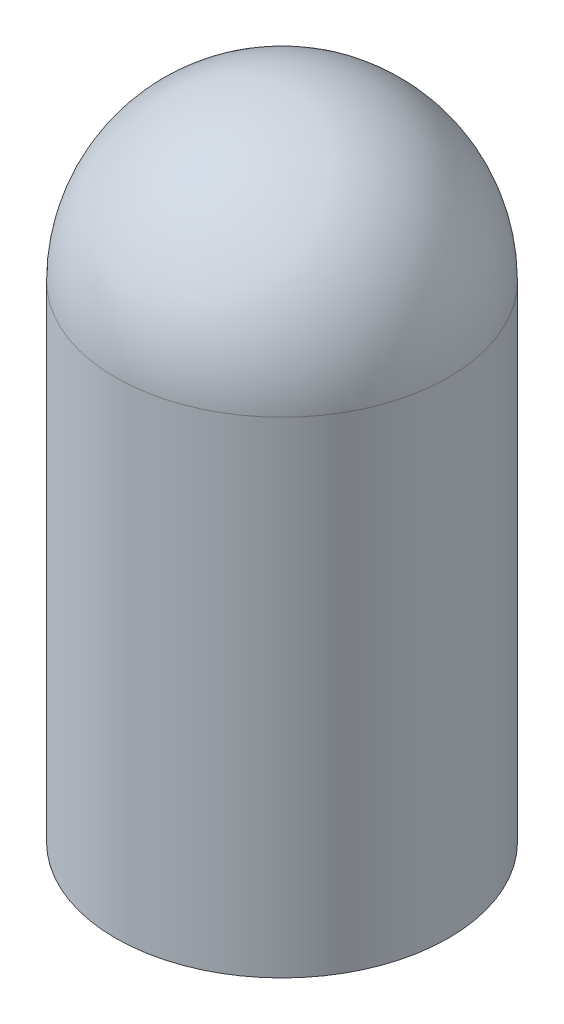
ISO-10303-21;
HEADER;
FILE_DESCRIPTION(('STEP AP214'),'2;1');
FILE_NAME('part.step','',(''),(''),'','','');
FILE_SCHEMA(('AUTOMOTIVE_DESIGN { 1 0 10303 214 1 1 1 1 }'));
ENDSEC;
DATA;
#1=APPLICATION_CONTEXT('core data for automotive mechanical design processes');
#2=APPLICATION_PROTOCOL_DEFINITION('international standard','automotive_design',2000,#1);
#3=PRODUCT_CONTEXT('',#1,'mechanical');
#4=PRODUCT('Part','Part','',(#3));
#5=PRODUCT_RELATED_PRODUCT_CATEGORY('part','',(#4));
#6=PRODUCT_DEFINITION_FORMATION('','',#4);
#7=PRODUCT_DEFINITION_CONTEXT('part definition',#1,'design');
#8=PRODUCT_DEFINITION('design','',#6,#7);
#9=PRODUCT_DEFINITION_SHAPE('','',#8);
#10=(LENGTH_UNIT() NAMED_UNIT(*) SI_UNIT(.MILLI.,.METRE.));
#11=(NAMED_UNIT(*) PLANE_ANGLE_UNIT() SI_UNIT($,.RADIAN.));
#12=(NAMED_UNIT(*) SI_UNIT($,.STERADIAN.) SOLID_ANGLE_UNIT());
#13=UNCERTAINTY_MEASURE_WITH_UNIT(LENGTH_MEASURE(1.E-05),#10,'distance_accuracy_value','');
#14=(GEOMETRIC_REPRESENTATION_CONTEXT(3) GLOBAL_UNCERTAINTY_ASSIGNED_CONTEXT((#13)) GLOBAL_UNIT_ASSIGNED_CONTEXT((#10,
#11,#12)) REPRESENTATION_CONTEXT('',''));
#15=CARTESIAN_POINT('',(0.,0.,0.));
#16=DIRECTION('',(0.,0.,1.));
#17=DIRECTION('',(1.,0.,0.));
#18=AXIS2_PLACEMENT_3D('',#15,#16,#17);
#19=CARTESIAN_POINT('',(-10.5,0.,0.));
#20=DIRECTION('',(0.,-1.,0.));
#21=DIRECTION('',(0.,0.,-1.));
#22=AXIS2_PLACEMENT_3D('',#19,#20,#21);
#23=PLANE('',#22);
#24=CARTESIAN_POINT('',(0.,0.,0.));
#25=DIRECTION('',(0.,1.,0.));
#26=DIRECTION('',(0.,0.,1.));
#27=AXIS2_PLACEMENT_3D('',#24,#25,#26);
#28=CIRCLE('',#27,10.5);
#29=CARTESIAN_POINT('',(0.,0.,10.5));
#30=VERTEX_POINT('',#29);
#31=EDGE_CURVE('E45',#30,#30,#28,.T.);
#32=ORIENTED_EDGE('',*,*,#31,.T.);
#33=EDGE_LOOP('',(#32));
#34=FACE_BOUND('',#33,.T.);
#35=CARTESIAN_POINT('',(0.,0.,0.));
#36=DIRECTION('',(0.,1.,0.));
#37=DIRECTION('',(0.,0.,1.));
#38=AXIS2_PLACEMENT_3D('',#35,#36,#37);
#39=CIRCLE('',#38,12.);
#40=CARTESIAN_POINT('',(0.,0.,12.));
#41=VERTEX_POINT('',#40);
#42=EDGE_CURVE('E10',#41,#41,#39,.T.);
#43=ORIENTED_EDGE('',*,*,#42,.F.);
#44=EDGE_LOOP('',(#43));
#45=FACE_BOUND('',#44,.T.);
#46=ADVANCED_FACE('F31',(#34,#45),#23,.T.);
#47=CARTESIAN_POINT('',(0.,0.,0.));
#48=DIRECTION('',(0.,1.,0.));
#49=DIRECTION('',(0.,0.,1.));
#50=AXIS2_PLACEMENT_3D('',#47,#48,#49);
#51=CYLINDRICAL_SURFACE('',#50,12.);
#52=ORIENTED_EDGE('',*,*,#42,.T.);
#53=EDGE_LOOP('',(#52));
#54=FACE_BOUND('',#53,.T.);
#55=CARTESIAN_POINT('',(0.,35.,0.));
#56=DIRECTION('',(0.,1.,0.));
#57=DIRECTION('',(0.,0.,1.));
#58=AXIS2_PLACEMENT_3D('',#55,#56,#57);
#59=CIRCLE('',#58,12.);
#60=CARTESIAN_POINT('',(0.,35.,12.));
#61=VERTEX_POINT('',#60);
#62=EDGE_CURVE('E37',#61,#61,#59,.T.);
#63=ORIENTED_EDGE('',*,*,#62,.F.);
#64=EDGE_LOOP('',(#63));
#65=FACE_BOUND('',#64,.T.);
#66=ADVANCED_FACE('F65',(#54,#65),#51,.T.);
#67=CARTESIAN_POINT('',(0.,35.,0.));
#68=DIRECTION('',(0.,1.,0.));
#69=DIRECTION('',(-1.,0.,0.));
#70=AXIS2_PLACEMENT_3D('',#67,#68,#69);
#71=SPHERICAL_SURFACE('',#70,12.);
#72=ORIENTED_EDGE('',*,*,#62,.T.);
#73=EDGE_LOOP('',(#72));
#74=FACE_BOUND('',#73,.T.);
#75=ADVANCED_FACE('F61',(#74),#71,.T.);
#76=CARTESIAN_POINT('',(0.,35.,0.));
#77=DIRECTION('',(0.,1.,0.));
#78=DIRECTION('',(-1.,0.,0.));
#79=AXIS2_PLACEMENT_3D('',#76,#77,#78);
#80=SPHERICAL_SURFACE('',#79,10.5);
#81=CARTESIAN_POINT('',(0.,35.,0.));
#82=DIRECTION('',(0.,1.,0.));
#83=DIRECTION('',(0.,0.,1.));
#84=AXIS2_PLACEMENT_3D('',#81,#82,#83);
#85=CIRCLE('',#84,10.5);
#86=CARTESIAN_POINT('',(0.,35.,10.5));
#87=VERTEX_POINT('',#86);
#88=EDGE_CURVE('E41',#87,#87,#85,.T.);
#89=ORIENTED_EDGE('',*,*,#88,.F.);
#90=EDGE_LOOP('',(#89));
#91=FACE_BOUND('',#90,.T.);
#92=ADVANCED_FACE('F55',(#91),#80,.F.);
#93=CARTESIAN_POINT('',(0.,0.,0.));
#94=DIRECTION('',(0.,1.,0.));
#95=DIRECTION('',(0.,0.,1.));
#96=AXIS2_PLACEMENT_3D('',#93,#94,#95);
#97=CYLINDRICAL_SURFACE('',#96,10.5);
#98=ORIENTED_EDGE('',*,*,#88,.T.);
#99=EDGE_LOOP('',(#98));
#100=FACE_BOUND('',#99,.T.);
#101=ORIENTED_EDGE('',*,*,#31,.F.);
#102=EDGE_LOOP('',(#101));
#103=FACE_BOUND('',#102,.T.);
#104=ADVANCED_FACE('F53',(#100,#103),#97,.F.);
#105=CLOSED_SHELL('',(#46,#66,#75,#92,#104));
#106=MANIFOLD_SOLID_BREP('B2',#105);
#107=ADVANCED_BREP_SHAPE_REPRESENTATION('',(#18,#106),#14);
#108=SHAPE_DEFINITION_REPRESENTATION(#9,#107);
ENDSEC;
END-ISO-10303-21;
